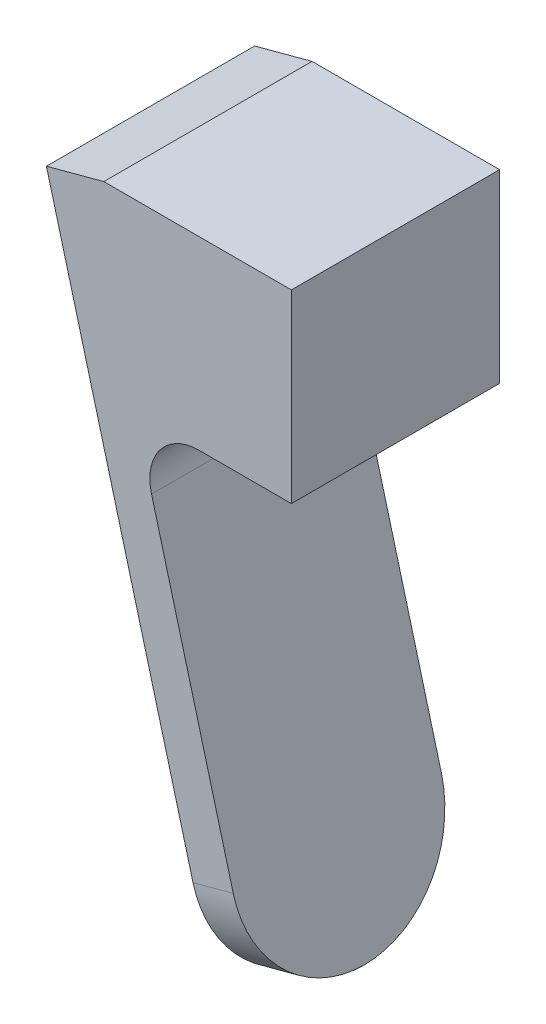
from build123d import *

# Parameters (mm, degrees)
BOSS_EXTRUDE1_DEPTH = 5.3975
FILLET1_R           = 2.54
CUT_EXTRUDE1_DEPTH  = 10.795


with BuildPart() as part:
    # Sketch1 → Boss-Extrude1 (new, symmetric)
    with BuildSketch(Plane.XY):
        Polygon((-8.225424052, -3.67171889), (0.622258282, -36.69171889), (2.857419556, -36.69171889), (-3.632754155, -12.470060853), (4.474575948, -12.470060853), (4.474575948, -2.874424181), (-5.24987969, -2.874424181), align=None)
    extrude(amount=BOSS_EXTRUDE1_DEPTH, both=True)

    # Fillet1
    fillet1_edges = [part.edges().sort_by_distance(p)[0] for p in [
        (-3.632754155, -12.470060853, 0),
    ]]
    fillet(fillet1_edges, radius=FILLET1_R)

    # Sketch2 → Cut-Extrude1 (cut)
    with BuildSketch(Plane(origin=(-6.506920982, -1.743524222, 0), x_dir=(0, 0, -1), z_dir=(0.9659258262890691, 0.2588190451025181, 0))):
        with BuildLine():
            Line((-5.3975, -30.783533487), (-9.351765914, -30.783533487))
            Line((-9.351765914, -30.783533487), (-9.351765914, -40.742477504))
            Line((-9.351765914, -40.742477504), (7.77118576, -40.742477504))
            Line((7.77118576, -40.742477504), (7.77118576, -30.783533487))
            Line((7.77118576, -30.783533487), (5.3975, -30.783533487))
            ThreePointArc((5.3975, -30.783533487), (0, -36.181033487), (-5.3975, -30.783533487))
        make_face()
    extrude(amount=-CUT_EXTRUDE1_DEPTH, mode=Mode.SUBTRACT)


solid = part.part
